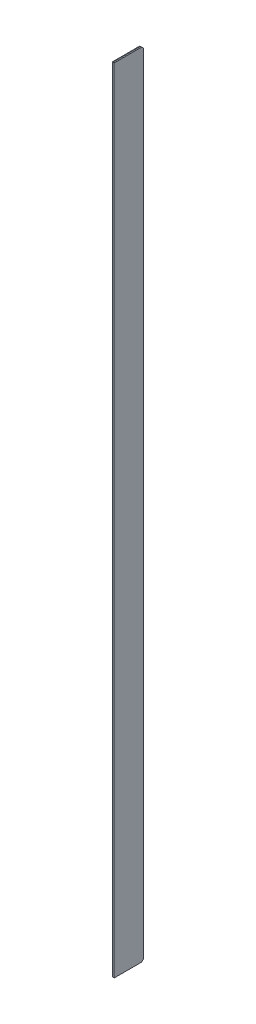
from build123d import *

# Parameters (mm, degrees)
SKETCH1_W               = 38.1
SKETCH1_H               = 609.6
BOSS_EXTRUDE1_DEPTH     = 16422.825
CHAMFER1_SIZE           = 13
CUT_EXTRUDE1_DEPTH      = 16426.664276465
CUT_EXTRUDE1_DEPTH_BACK = 16426.664276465


with BuildPart() as part:
    # Sketch1 → Boss-Extrude1 (new body)
    with BuildSketch(Plane(origin=(0, 0, 0), x_dir=(-1, 0, 0), z_dir=(0, 1, 0))):
        Rectangle(SKETCH1_W, SKETCH1_H)
    extrude(amount=BOSS_EXTRUDE1_DEPTH)

    # Chamfer1
    chamfer1_edges = [part.edges().sort_by_distance(p)[0] for p in [
        (19.05, 16422.825, 0),
        (0, 16422.825, -304.8),
        (-19.05, 16422.825, 0),
        (0, 0, -304.8),
        (19.05, 0, 0),
        (0, 0, 304.8),
        (-19.05, 0, 0),
        (0, 16422.825, 304.8),
    ]]
    chamfer(chamfer1_edges, length=CHAMFER1_SIZE)

    # Sketch2 → Cut-Extrude1 (cut, two sides: drawn at the far end of the back side and taken through both)
    with BuildSketch(Plane.YZ.offset(-CUT_EXTRUDE1_DEPTH_BACK)):
        Polygon((0, -304.8), (0, -249.8), (55, -304.8), align=None)
        Polygon((16367.825, -304.8), (16422.825, -304.8), (16422.825, -249.8), align=None)
    extrude(amount=CUT_EXTRUDE1_DEPTH + CUT_EXTRUDE1_DEPTH_BACK, mode=Mode.SUBTRACT)


solid = part.part
